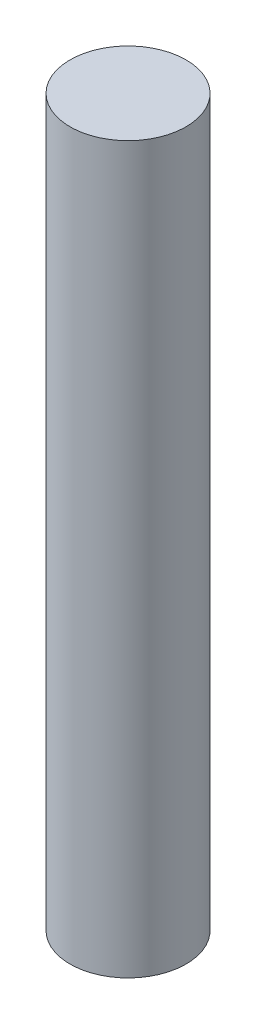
ISO-10303-21;
HEADER;
FILE_DESCRIPTION(('STEP AP214'),'2;1');
FILE_NAME('part.step','',(''),(''),'','','');
FILE_SCHEMA(('AUTOMOTIVE_DESIGN { 1 0 10303 214 1 1 1 1 }'));
ENDSEC;
DATA;
#1=APPLICATION_CONTEXT('core data for automotive mechanical design processes');
#2=APPLICATION_PROTOCOL_DEFINITION('international standard','automotive_design',2000,#1);
#3=PRODUCT_CONTEXT('',#1,'mechanical');
#4=PRODUCT('Part','Part','',(#3));
#5=PRODUCT_RELATED_PRODUCT_CATEGORY('part','',(#4));
#6=PRODUCT_DEFINITION_FORMATION('','',#4);
#7=PRODUCT_DEFINITION_CONTEXT('part definition',#1,'design');
#8=PRODUCT_DEFINITION('design','',#6,#7);
#9=PRODUCT_DEFINITION_SHAPE('','',#8);
#10=(LENGTH_UNIT() NAMED_UNIT(*) SI_UNIT(.MILLI.,.METRE.));
#11=(NAMED_UNIT(*) PLANE_ANGLE_UNIT() SI_UNIT($,.RADIAN.));
#12=(NAMED_UNIT(*) SI_UNIT($,.STERADIAN.) SOLID_ANGLE_UNIT());
#13=UNCERTAINTY_MEASURE_WITH_UNIT(LENGTH_MEASURE(1.E-05),#10,'distance_accuracy_value','');
#14=(GEOMETRIC_REPRESENTATION_CONTEXT(3) GLOBAL_UNCERTAINTY_ASSIGNED_CONTEXT((#13)) GLOBAL_UNIT_ASSIGNED_CONTEXT((#10,
#11,#12)) REPRESENTATION_CONTEXT('',''));
#15=CARTESIAN_POINT('',(0.,0.,0.));
#16=DIRECTION('',(0.,0.,1.));
#17=DIRECTION('',(1.,0.,0.));
#18=AXIS2_PLACEMENT_3D('',#15,#16,#17);
#19=CARTESIAN_POINT('',(0.,25.,0.));
#20=DIRECTION('',(0.,1.,0.));
#21=DIRECTION('',(0.,0.,1.));
#22=AXIS2_PLACEMENT_3D('',#19,#20,#21);
#23=PLANE('',#22);
#24=CARTESIAN_POINT('',(0.,25.,0.));
#25=DIRECTION('',(0.,-1.,0.));
#26=DIRECTION('',(0.,0.,-1.));
#27=AXIS2_PLACEMENT_3D('',#24,#25,#26);
#28=CIRCLE('',#27,2.);
#29=CARTESIAN_POINT('',(0.,25.,-2.));
#30=VERTEX_POINT('',#29);
#31=EDGE_CURVE('E18',#30,#30,#28,.T.);
#32=ORIENTED_EDGE('',*,*,#31,.F.);
#33=EDGE_LOOP('',(#32));
#34=FACE_BOUND('',#33,.T.);
#35=ADVANCED_FACE('F15',(#34),#23,.T.);
#36=CARTESIAN_POINT('',(0.,0.,0.));
#37=DIRECTION('',(0.,1.,0.));
#38=DIRECTION('',(0.,0.,1.));
#39=AXIS2_PLACEMENT_3D('',#36,#37,#38);
#40=PLANE('',#39);
#41=CARTESIAN_POINT('',(0.,0.,0.));
#42=DIRECTION('',(0.,-1.,0.));
#43=DIRECTION('',(0.,0.,-1.));
#44=AXIS2_PLACEMENT_3D('',#41,#42,#43);
#45=CIRCLE('',#44,2.);
#46=CARTESIAN_POINT('',(0.,0.,-2.));
#47=VERTEX_POINT('',#46);
#48=EDGE_CURVE('E10',#47,#47,#45,.F.);
#49=ORIENTED_EDGE('',*,*,#48,.F.);
#50=EDGE_LOOP('',(#49));
#51=FACE_BOUND('',#50,.T.);
#52=ADVANCED_FACE('F30',(#51),#40,.F.);
#53=CARTESIAN_POINT('',(0.,25.,0.));
#54=DIRECTION('',(0.,-1.,0.));
#55=DIRECTION('',(0.,0.,-1.));
#56=AXIS2_PLACEMENT_3D('',#53,#54,#55);
#57=CYLINDRICAL_SURFACE('',#56,2.);
#58=ORIENTED_EDGE('',*,*,#48,.T.);
#59=EDGE_LOOP('',(#58));
#60=FACE_BOUND('',#59,.T.);
#61=ORIENTED_EDGE('',*,*,#31,.T.);
#62=EDGE_LOOP('',(#61));
#63=FACE_BOUND('',#62,.T.);
#64=ADVANCED_FACE('F27',(#60,#63),#57,.T.);
#65=CLOSED_SHELL('',(#35,#52,#64));
#66=MANIFOLD_SOLID_BREP('B1',#65);
#67=ADVANCED_BREP_SHAPE_REPRESENTATION('',(#18,#66),#14);
#68=SHAPE_DEFINITION_REPRESENTATION(#9,#67);
ENDSEC;
END-ISO-10303-21;
